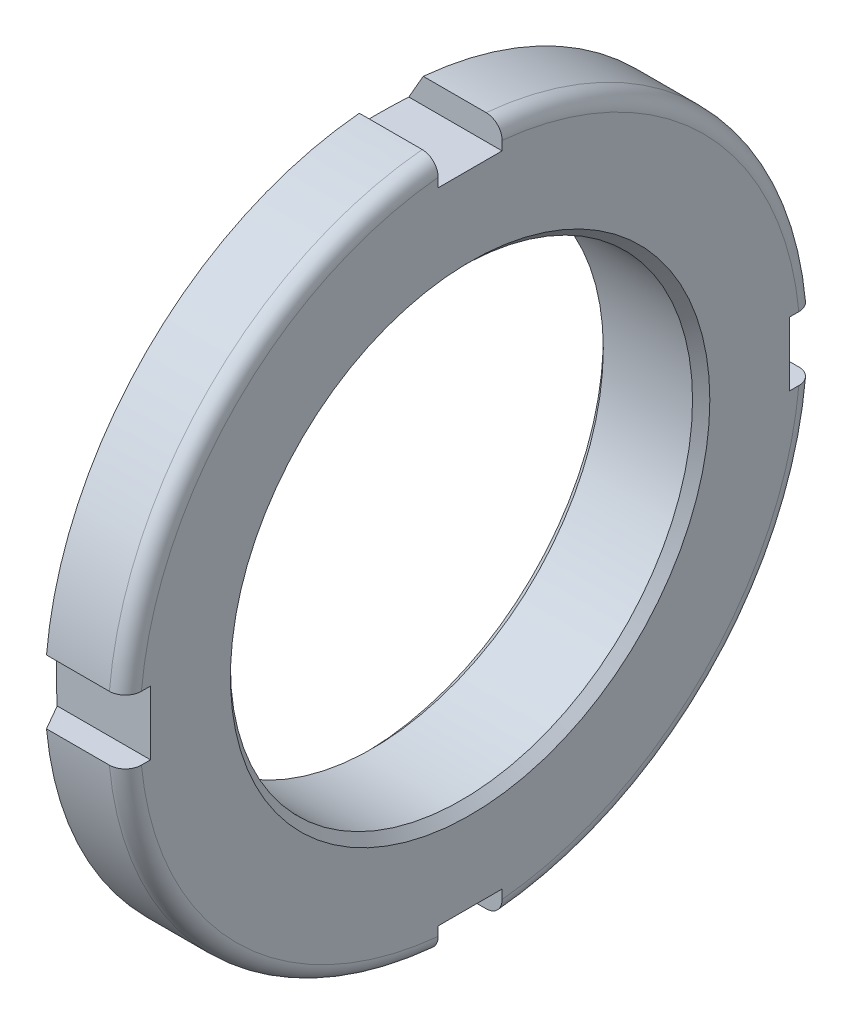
from build123d import *

# Parameters (mm, degrees)
CUT_EXTRUDE1_REACH    = 49.037
CUT_EXTRUDE2_REACH    = 49.037
CUT_EXTRUDE3_REACH    = 49.037
CUT_EXTRUDE4_REACH    = 48.941
M39_CLEARANCE_HOLE1_D = 43.37625
CHAMFER1_SIZE         = 0.811875
FILLET1_R             = 1.5


with BuildPart() as part:
    # Sketch1 → Revolve1 (revolve)
    with BuildSketch(Plane.XY, mode=Mode.PRIVATE) as revolve1_sk:
        Polygon((0, 28), (0, 0), (10, 0), (10, 32.5), (2.598076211, 32.5), align=None)
    revolve(revolve1_sk.sketch.rotate(Axis((0, 0, 0), (1, 0, 0)), 270), axis=Axis((0, 0, 0), (1, 0, 0)))

    # Cut-Extrude1: up to this cone (the profile starts inside it)
    cut_extrude1_end = Plane(origin=(10, 0, 0), z_dir=(1, 0, 0)).offset(-26.165806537) * Cone(1.732e-06, 209.618531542, 121.023314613, align=(Align.CENTER, Align.CENTER, Align.MIN), mode=Mode.PRIVATE)
    # Sketch2 → Cut-Extrude1 (cut, up to the surface)
    with BuildSketch(Plane(origin=(10, 0, 0), x_dir=(0, 0, -1), z_dir=(1, 0, 0)), mode=Mode.PRIVATE) as cut_extrude1_sk1:
        with BuildLine():
            Line((3, -32.361242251), (3, -30))
            Line((3, -30), (-3, -30))
            Line((-3, -30), (-3, -32.361242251))
            ThreePointArc((-3, -32.361242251), (0, -32.5), (3, -32.361242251))
        make_face()
    cut_extrude1_tool1 = extrude(cut_extrude1_sk1.sketch, amount=-CUT_EXTRUDE1_REACH, mode=Mode.PRIVATE) & cut_extrude1_end
    add(cut_extrude1_tool1.solids().sort_by_distance((10, -31.227242, 0))[0], mode=Mode.SUBTRACT)

    # Cut-Extrude2: up to this cone (the profile starts inside it)
    cut_extrude2_end = Plane(origin=(10, 0, 0), z_dir=(1, 0, 0)).offset(-26.165806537) * Cone(1.732e-06, 209.618531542, 121.023314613, align=(Align.CENTER, Align.CENTER, Align.MIN), mode=Mode.PRIVATE)
    # Sketch3 → Cut-Extrude2 (cut, up to the surface)
    with BuildSketch(Plane(origin=(10, 0, 0), x_dir=(0, 0, -1), z_dir=(1, 0, 0)), mode=Mode.PRIVATE) as cut_extrude2_sk1:
        with BuildLine():
            Line((32.361242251, 3), (30, 3))
            Line((30, 3), (30, -3))
            Line((30, -3), (32.361242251, -3))
            ThreePointArc((32.361242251, -3), (32.5, 0), (32.361242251, 3))
        make_face()
    cut_extrude2_tool1 = extrude(cut_extrude2_sk1.sketch, amount=-CUT_EXTRUDE2_REACH, mode=Mode.PRIVATE) & cut_extrude2_end
    add(cut_extrude2_tool1.solids().sort_by_distance((10, 0, -31.227242))[0], mode=Mode.SUBTRACT)

    # Cut-Extrude3: up to this cone (the profile starts inside it)
    cut_extrude3_end = Plane(origin=(10, 0, 0), z_dir=(1, 0, 0)).offset(-26.165806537) * Cone(1.732e-06, 209.618531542, 121.023314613, align=(Align.CENTER, Align.CENTER, Align.MIN), mode=Mode.PRIVATE)
    # Sketch4 → Cut-Extrude3 (cut, up to the surface)
    with BuildSketch(Plane(origin=(10, 0, 0), x_dir=(0, 0, -1), z_dir=(1, 0, 0)), mode=Mode.PRIVATE) as cut_extrude3_sk1:
        with BuildLine():
            Line((-3, 32.361242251), (-3, 30))
            Line((-3, 30), (3, 30))
            Line((3, 30), (3, 32.361242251))
            ThreePointArc((3, 32.361242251), (0, 32.5), (-3, 32.361242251))
        make_face()
    cut_extrude3_tool1 = extrude(cut_extrude3_sk1.sketch, amount=-CUT_EXTRUDE3_REACH, mode=Mode.PRIVATE) & cut_extrude3_end
    add(cut_extrude3_tool1.solids().sort_by_distance((10, 31.227242, 0))[0], mode=Mode.SUBTRACT)

    # Cut-Extrude4: up to this cone (the profile starts inside it)
    cut_extrude4_end = Plane(origin=(10, 0, 0), z_dir=(1, 0, 0)).offset(-26.165806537) * Cone(1.732e-06, 209.452254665, 120.927314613, align=(Align.CENTER, Align.CENTER, Align.MIN), mode=Mode.PRIVATE)
    # Sketch5 → Cut-Extrude4 (cut, up to the surface)
    with BuildSketch(Plane(origin=(10, 0, 0), x_dir=(0, 0, -1), z_dir=(1, 0, 0)), mode=Mode.PRIVATE) as cut_extrude4_sk1:
        with BuildLine():
            Line((-32.361242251, -3), (-30, -3))
            Line((-30, -3), (-30, 3))
            Line((-30, 3), (-32.361242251, 3))
            ThreePointArc((-32.361242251, 3), (-32.5, 0), (-32.361242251, -3))
        make_face()
    cut_extrude4_tool1 = extrude(cut_extrude4_sk1.sketch, amount=-CUT_EXTRUDE4_REACH, mode=Mode.PRIVATE) & cut_extrude4_end
    add(cut_extrude4_tool1.solids().sort_by_distance((10, 0, 31.227242))[0], mode=Mode.SUBTRACT)

    # M39 Clearance Hole1 (through all)
    with Locations(Plane.ZY):
        with Locations((0, 0)):
            Hole(M39_CLEARANCE_HOLE1_D / 2)

    # Chamfer1
    chamfer1_edges = [part.edges().sort_by_distance(p)[0] for p in [
        (0, 0, 21.688125),
        (10, 0, 21.688125),
    ]]
    chamfer(chamfer1_edges, length=CHAMFER1_SIZE)

    # Fillet1
    fillet1_edges = [part.edges().sort_by_distance(p)[0] for p in [
        (10, -22.980970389, -22.980970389),
        (10, 22.980970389, -22.980970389),
        (10, 22.980970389, 22.980970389),
        (10, -22.980970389, 22.980970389),
    ]]
    fillet(fillet1_edges, radius=FILLET1_R)


solid = part.part
